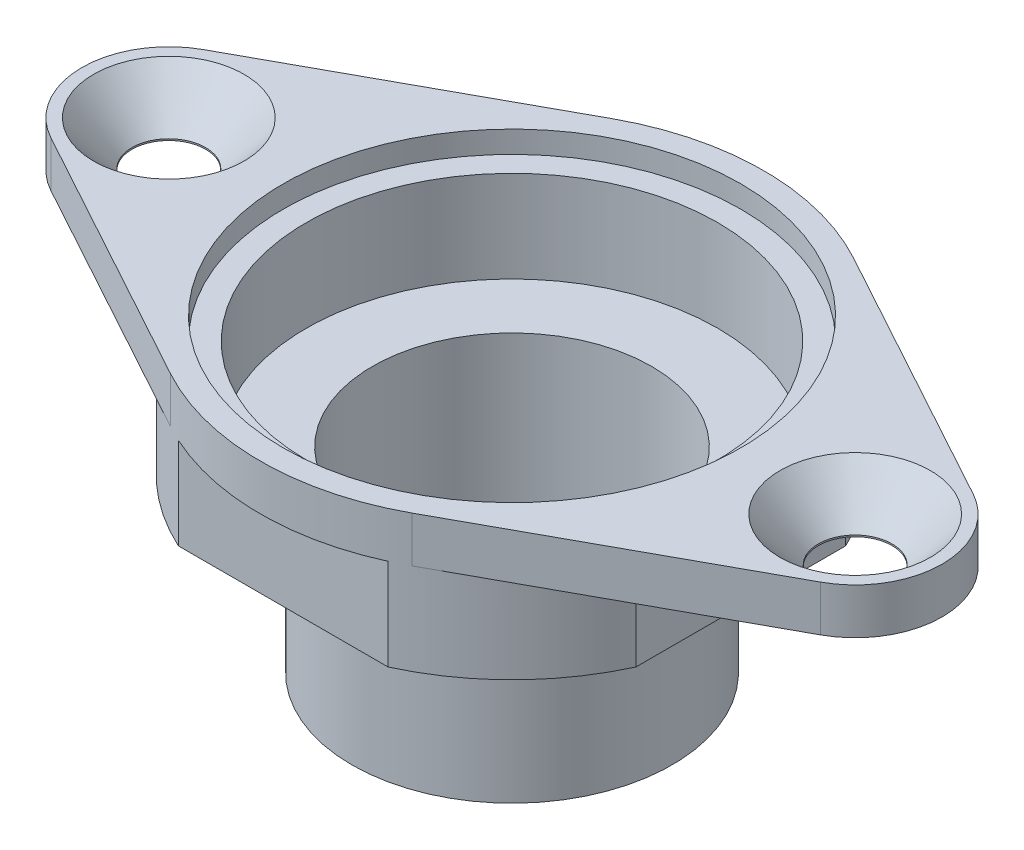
ISO-10303-21;
HEADER;
FILE_DESCRIPTION(('STEP AP214'),'2;1');
FILE_NAME('part.step','',(''),(''),'','','');
FILE_SCHEMA(('AUTOMOTIVE_DESIGN { 1 0 10303 214 1 1 1 1 }'));
ENDSEC;
DATA;
#1=APPLICATION_CONTEXT('core data for automotive mechanical design processes');
#2=APPLICATION_PROTOCOL_DEFINITION('international standard','automotive_design',2000,#1);
#3=PRODUCT_CONTEXT('',#1,'mechanical');
#4=PRODUCT('Part','Part','',(#3));
#5=PRODUCT_RELATED_PRODUCT_CATEGORY('part','',(#4));
#6=PRODUCT_DEFINITION_FORMATION('','',#4);
#7=PRODUCT_DEFINITION_CONTEXT('part definition',#1,'design');
#8=PRODUCT_DEFINITION('design','',#6,#7);
#9=PRODUCT_DEFINITION_SHAPE('','',#8);
#10=(LENGTH_UNIT() NAMED_UNIT(*) SI_UNIT(.MILLI.,.METRE.));
#11=(NAMED_UNIT(*) PLANE_ANGLE_UNIT() SI_UNIT($,.RADIAN.));
#12=(NAMED_UNIT(*) SI_UNIT($,.STERADIAN.) SOLID_ANGLE_UNIT());
#13=UNCERTAINTY_MEASURE_WITH_UNIT(LENGTH_MEASURE(1.E-05),#10,'distance_accuracy_value','');
#14=(GEOMETRIC_REPRESENTATION_CONTEXT(3) GLOBAL_UNCERTAINTY_ASSIGNED_CONTEXT((#13)) GLOBAL_UNIT_ASSIGNED_CONTEXT((#10,
#11,#12)) REPRESENTATION_CONTEXT('',''));
#15=CARTESIAN_POINT('',(0.,0.,0.));
#16=DIRECTION('',(0.,0.,1.));
#17=DIRECTION('',(1.,0.,0.));
#18=AXIS2_PLACEMENT_3D('',#15,#16,#17);
#19=CARTESIAN_POINT('',(58.4581,-3.175,-20.10787784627));
#20=DIRECTION('',(0.48,0.,0.877268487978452));
#21=DIRECTION('',(0.877268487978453,0.,-0.48));
#22=AXIS2_PLACEMENT_3D('',#19,#20,#21);
#23=PLANE('',#22);
#24=DIRECTION('',(0.,1.,0.));
#25=VECTOR('',#24,1.);
#26=CARTESIAN_POINT('',(40.132,-3.175,-10.0806990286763));
#27=LINE('',#26,#25);
#28=CARTESIAN_POINT('',(40.132,19.05,-10.0806990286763));
#29=VERTEX_POINT('',#28);
#30=CARTESIAN_POINT('',(40.132,22.225,-10.0806990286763));
#31=VERTEX_POINT('',#30);
#32=EDGE_CURVE('E313',#29,#31,#27,.T.);
#33=ORIENTED_EDGE('',*,*,#32,.F.);
#34=DIRECTION('',(0.877268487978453,0.,-0.48));
#35=VECTOR('',#34,1.);
#36=CARTESIAN_POINT('',(58.4581,19.05,-20.10787784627));
#37=LINE('',#36,#35);
#38=CARTESIAN_POINT('',(58.4581,19.05,-20.10787784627));
#39=VERTEX_POINT('',#38);
#40=EDGE_CURVE('E275',#29,#39,#37,.T.);
#41=ORIENTED_EDGE('',*,*,#40,.T.);
#42=DIRECTION('',(0.,1.,0.));
#43=VECTOR('',#42,1.);
#44=CARTESIAN_POINT('',(58.4581,-3.175,-20.10787784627));
#45=LINE('',#44,#43);
#46=CARTESIAN_POINT('',(58.4581,22.225,-20.10787784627));
#47=VERTEX_POINT('',#46);
#48=EDGE_CURVE('E200',#39,#47,#45,.T.);
#49=ORIENTED_EDGE('',*,*,#48,.T.);
#50=DIRECTION('',(0.877268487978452,0.,-0.48));
#51=VECTOR('',#50,1.);
#52=CARTESIAN_POINT('',(58.4581,22.225,-20.10787784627));
#53=LINE('',#52,#51);
#54=EDGE_CURVE('E195',#31,#47,#53,.T.);
#55=ORIENTED_EDGE('',*,*,#54,.F.);
#56=EDGE_LOOP('',(#33,#41,#49,#55));
#57=FACE_BOUND('',#56,.T.);
#58=ADVANCED_FACE('F40',(#57),#23,.T.);
#59=CARTESIAN_POINT('',(5.04190000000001,-3.175,-20.10787784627));
#60=DIRECTION('',(-0.48,0.,0.877268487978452));
#61=DIRECTION('',(0.877268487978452,0.,0.48));
#62=AXIS2_PLACEMENT_3D('',#59,#60,#61);
#63=PLANE('',#62);
#64=DIRECTION('',(0.877268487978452,0.,0.48));
#65=VECTOR('',#64,1.);
#66=CARTESIAN_POINT('',(5.04190000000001,19.05,-20.10787784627));
#67=LINE('',#66,#65);
#68=CARTESIAN_POINT('',(5.04190000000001,19.05,-20.10787784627));
#69=VERTEX_POINT('',#68);
#70=CARTESIAN_POINT('',(23.368,19.05,-10.0806990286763));
#71=VERTEX_POINT('',#70);
#72=EDGE_CURVE('E281',#69,#71,#67,.T.);
#73=ORIENTED_EDGE('',*,*,#72,.T.);
#74=DIRECTION('',(0.,1.,0.));
#75=VECTOR('',#74,1.);
#76=CARTESIAN_POINT('',(23.368,-3.175,-10.0806990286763));
#77=LINE('',#76,#75);
#78=CARTESIAN_POINT('',(23.368,22.225,-10.0806990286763));
#79=VERTEX_POINT('',#78);
#80=EDGE_CURVE('E315',#71,#79,#77,.T.);
#81=ORIENTED_EDGE('',*,*,#80,.T.);
#82=DIRECTION('',(0.877268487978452,0.,0.48));
#83=VECTOR('',#82,1.);
#84=CARTESIAN_POINT('',(5.04190000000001,22.225,-20.10787784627));
#85=LINE('',#84,#83);
#86=CARTESIAN_POINT('',(5.0419,22.225,-20.10787784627));
#87=VERTEX_POINT('',#86);
#88=EDGE_CURVE('E304',#87,#79,#85,.T.);
#89=ORIENTED_EDGE('',*,*,#88,.F.);
#90=DIRECTION('',(0.,1.,0.));
#91=VECTOR('',#90,1.);
#92=CARTESIAN_POINT('',(5.0419,-3.175,-20.10787784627));
#93=LINE('',#92,#91);
#94=EDGE_CURVE('E188',#69,#87,#93,.T.);
#95=ORIENTED_EDGE('',*,*,#94,.F.);
#96=EDGE_LOOP('',(#73,#81,#89,#95));
#97=FACE_BOUND('',#96,.T.);
#98=ADVANCED_FACE('F322',(#97),#63,.T.);
#99=CARTESIAN_POINT('',(5.0419,-3.175,-30.69212215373));
#100=DIRECTION('',(-0.48,0.,-0.877268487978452));
#101=DIRECTION('',(-0.877268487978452,0.,0.48));
#102=AXIS2_PLACEMENT_3D('',#99,#100,#101);
#103=PLANE('',#102);
#104=DIRECTION('',(0.,1.,0.));
#105=VECTOR('',#104,1.);
#106=CARTESIAN_POINT('',(23.368,-3.175,-40.7193009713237));
#107=LINE('',#106,#105);
#108=CARTESIAN_POINT('',(23.368,19.05,-40.7193009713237));
#109=VERTEX_POINT('',#108);
#110=CARTESIAN_POINT('',(23.368,22.225,-40.7193009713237));
#111=VERTEX_POINT('',#110);
#112=EDGE_CURVE('E173',#109,#111,#107,.T.);
#113=ORIENTED_EDGE('',*,*,#112,.F.);
#114=DIRECTION('',(-0.877268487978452,0.,0.48));
#115=VECTOR('',#114,1.);
#116=CARTESIAN_POINT('',(5.0419,19.05,-30.69212215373));
#117=LINE('',#116,#115);
#118=CARTESIAN_POINT('',(5.0419,19.05,-30.69212215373));
#119=VERTEX_POINT('',#118);
#120=EDGE_CURVE('E156',#109,#119,#117,.T.);
#121=ORIENTED_EDGE('',*,*,#120,.T.);
#122=DIRECTION('',(0.,1.,0.));
#123=VECTOR('',#122,1.);
#124=CARTESIAN_POINT('',(5.0419,-3.175,-30.69212215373));
#125=LINE('',#124,#123);
#126=CARTESIAN_POINT('',(5.0419,22.225,-30.69212215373));
#127=VERTEX_POINT('',#126);
#128=EDGE_CURVE('E185',#119,#127,#125,.T.);
#129=ORIENTED_EDGE('',*,*,#128,.T.);
#130=DIRECTION('',(-0.877268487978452,0.,0.48));
#131=VECTOR('',#130,1.);
#132=CARTESIAN_POINT('',(5.0419,22.225,-30.69212215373));
#133=LINE('',#132,#131);
#134=EDGE_CURVE('E183',#111,#127,#133,.T.);
#135=ORIENTED_EDGE('',*,*,#134,.F.);
#136=EDGE_LOOP('',(#113,#121,#129,#135));
#137=FACE_BOUND('',#136,.T.);
#138=ADVANCED_FACE('F181',(#137),#103,.T.);
#139=CARTESIAN_POINT('',(40.132,-3.175,-40.7193009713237));
#140=DIRECTION('',(0.48,0.,-0.877268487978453));
#141=DIRECTION('',(-0.877268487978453,0.,-0.48));
#142=AXIS2_PLACEMENT_3D('',#139,#140,#141);
#143=PLANE('',#142);
#144=DIRECTION('',(-0.877268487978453,0.,-0.48));
#145=VECTOR('',#144,1.);
#146=CARTESIAN_POINT('',(40.132,19.05,-40.7193009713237));
#147=LINE('',#146,#145);
#148=CARTESIAN_POINT('',(58.4581,19.05,-30.69212215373));
#149=VERTEX_POINT('',#148);
#150=CARTESIAN_POINT('',(40.132,19.05,-40.7193009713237));
#151=VERTEX_POINT('',#150);
#152=EDGE_CURVE('E219',#149,#151,#147,.T.);
#153=ORIENTED_EDGE('',*,*,#152,.T.);
#154=DIRECTION('',(0.,1.,0.));
#155=VECTOR('',#154,1.);
#156=CARTESIAN_POINT('',(40.132,-3.175,-40.7193009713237));
#157=LINE('',#156,#155);
#158=CARTESIAN_POINT('',(40.132,22.225,-40.7193009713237));
#159=VERTEX_POINT('',#158);
#160=EDGE_CURVE('E186',#151,#159,#157,.T.);
#161=ORIENTED_EDGE('',*,*,#160,.T.);
#162=DIRECTION('',(-0.877268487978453,0.,-0.48));
#163=VECTOR('',#162,1.);
#164=CARTESIAN_POINT('',(40.132,22.225,-40.7193009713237));
#165=LINE('',#164,#163);
#166=CARTESIAN_POINT('',(58.4581,22.225,-30.69212215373));
#167=VERTEX_POINT('',#166);
#168=EDGE_CURVE('E295',#167,#159,#165,.T.);
#169=ORIENTED_EDGE('',*,*,#168,.F.);
#170=DIRECTION('',(0.,1.,0.));
#171=VECTOR('',#170,1.);
#172=CARTESIAN_POINT('',(58.4581,-3.175,-30.69212215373));
#173=LINE('',#172,#171);
#174=EDGE_CURVE('E190',#149,#167,#173,.T.);
#175=ORIENTED_EDGE('',*,*,#174,.F.);
#176=EDGE_LOOP('',(#153,#161,#169,#175));
#177=FACE_BOUND('',#176,.T.);
#178=ADVANCED_FACE('F331',(#177),#143,.T.);
#179=CARTESIAN_POINT('',(47.625,19.05,-9.52499999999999));
#180=DIRECTION('',(1.,0.,0.));
#181=DIRECTION('',(0.,0.,-1.));
#182=AXIS2_PLACEMENT_3D('',#179,#180,#181);
#183=PLANE('',#182);
#184=DIRECTION('',(0.,0.,1.));
#185=VECTOR('',#184,1.);
#186=CARTESIAN_POINT('',(47.625,19.05,-9.52499999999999));
#187=LINE('',#186,#185);
#188=CARTESIAN_POINT('',(47.625,19.05,-32.6748389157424));
#189=VERTEX_POINT('',#188);
#190=CARTESIAN_POINT('',(47.625,19.05,-18.1251610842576));
#191=VERTEX_POINT('',#190);
#192=EDGE_CURVE('E266',#189,#191,#187,.T.);
#193=ORIENTED_EDGE('',*,*,#192,.T.);
#194=DIRECTION('',(0.,-1.,0.));
#195=VECTOR('',#194,1.);
#196=CARTESIAN_POINT('',(47.625,88.8982857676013,-18.1251610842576));
#197=LINE('',#196,#195);
#198=CARTESIAN_POINT('',(47.625,12.7,-18.1251610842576));
#199=VERTEX_POINT('',#198);
#200=EDGE_CURVE('E245',#191,#199,#197,.T.);
#201=ORIENTED_EDGE('',*,*,#200,.T.);
#202=DIRECTION('',(0.,0.,-1.));
#203=VECTOR('',#202,1.);
#204=CARTESIAN_POINT('',(47.625,12.7,-9.52499999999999));
#205=LINE('',#204,#203);
#206=CARTESIAN_POINT('',(47.625,12.7,-32.6748389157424));
#207=VERTEX_POINT('',#206);
#208=EDGE_CURVE('E250',#199,#207,#205,.T.);
#209=ORIENTED_EDGE('',*,*,#208,.T.);
#210=DIRECTION('',(0.,-1.,0.));
#211=VECTOR('',#210,1.);
#212=CARTESIAN_POINT('',(47.625,88.8982857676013,-32.6748389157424));
#213=LINE('',#212,#211);
#214=EDGE_CURVE('E342',#207,#189,#213,.F.);
#215=ORIENTED_EDGE('',*,*,#214,.T.);
#216=EDGE_LOOP('',(#193,#201,#209,#215));
#217=FACE_BOUND('',#216,.T.);
#218=ADVANCED_FACE('F345',(#217),#183,.T.);
#219=CARTESIAN_POINT('',(15.875,19.05,-9.52499999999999));
#220=DIRECTION('',(-1.,0.,0.));
#221=DIRECTION('',(0.,0.,1.));
#222=AXIS2_PLACEMENT_3D('',#219,#220,#221);
#223=PLANE('',#222);
#224=DIRECTION('',(0.,0.,-1.));
#225=VECTOR('',#224,1.);
#226=CARTESIAN_POINT('',(15.875,19.05,-9.52499999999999));
#227=LINE('',#226,#225);
#228=CARTESIAN_POINT('',(15.875,19.05,-18.1251610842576));
#229=VERTEX_POINT('',#228);
#230=CARTESIAN_POINT('',(15.875,19.05,-32.6748389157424));
#231=VERTEX_POINT('',#230);
#232=EDGE_CURVE('E261',#229,#231,#227,.T.);
#233=ORIENTED_EDGE('',*,*,#232,.T.);
#234=DIRECTION('',(0.,-1.,0.));
#235=VECTOR('',#234,1.);
#236=CARTESIAN_POINT('',(15.875,88.8982857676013,-32.6748389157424));
#237=LINE('',#236,#235);
#238=CARTESIAN_POINT('',(15.875,12.7,-32.6748389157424));
#239=VERTEX_POINT('',#238);
#240=EDGE_CURVE('E176',#231,#239,#237,.T.);
#241=ORIENTED_EDGE('',*,*,#240,.T.);
#242=DIRECTION('',(0.,0.,1.));
#243=VECTOR('',#242,1.);
#244=CARTESIAN_POINT('',(15.875,12.7,-9.52499999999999));
#245=LINE('',#244,#243);
#246=CARTESIAN_POINT('',(15.875,12.7,-18.1251610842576));
#247=VERTEX_POINT('',#246);
#248=EDGE_CURVE('E254',#239,#247,#245,.T.);
#249=ORIENTED_EDGE('',*,*,#248,.T.);
#250=DIRECTION('',(0.,-1.,0.));
#251=VECTOR('',#250,1.);
#252=CARTESIAN_POINT('',(15.875,88.8982857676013,-18.1251610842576));
#253=LINE('',#252,#251);
#254=EDGE_CURVE('E177',#247,#229,#253,.F.);
#255=ORIENTED_EDGE('',*,*,#254,.T.);
#256=EDGE_LOOP('',(#233,#241,#249,#255));
#257=FACE_BOUND('',#256,.T.);
#258=ADVANCED_FACE('F516',(#257),#223,.T.);
#259=CARTESIAN_POINT('',(31.75,12.7,-25.4));
#260=DIRECTION('',(0.,-1.,0.));
#261=DIRECTION('',(0.,0.,-1.));
#262=AXIS2_PLACEMENT_3D('',#259,#260,#261);
#263=PLANE('',#262);
#264=CARTESIAN_POINT('',(31.75,12.7,-25.4));
#265=DIRECTION('',(0.,-1.,0.));
#266=DIRECTION('',(0.,0.,-1.));
#267=AXIS2_PLACEMENT_3D('',#264,#265,#266);
#268=CIRCLE('',#267,11.1125);
#269=CARTESIAN_POINT('',(31.75,12.7,-36.5125));
#270=VERTEX_POINT('',#269);
#271=EDGE_CURVE('E233',#270,#270,#268,.T.);
#272=ORIENTED_EDGE('',*,*,#271,.F.);
#273=EDGE_LOOP('',(#272));
#274=FACE_BOUND('',#273,.T.);
#275=CARTESIAN_POINT('',(31.75,12.7,-25.4));
#276=DIRECTION('',(0.,-1.,0.));
#277=DIRECTION('',(0.,0.,-1.));
#278=AXIS2_PLACEMENT_3D('',#275,#276,#277);
#279=CIRCLE('',#278,17.4625);
#280=CARTESIAN_POINT('',(39.0248389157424,12.7,-41.275));
#281=VERTEX_POINT('',#280);
#282=EDGE_CURVE('E64',#207,#281,#279,.F.);
#283=ORIENTED_EDGE('',*,*,#282,.F.);
#284=ORIENTED_EDGE('',*,*,#208,.F.);
#285=CARTESIAN_POINT('',(31.75,12.7,-25.4));
#286=DIRECTION('',(0.,-1.,0.));
#287=DIRECTION('',(0.,0.,-1.));
#288=AXIS2_PLACEMENT_3D('',#285,#286,#287);
#289=CIRCLE('',#288,17.4625);
#290=CARTESIAN_POINT('',(39.0248389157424,12.7,-9.525));
#291=VERTEX_POINT('',#290);
#292=EDGE_CURVE('E238',#291,#199,#289,.F.);
#293=ORIENTED_EDGE('',*,*,#292,.F.);
#294=DIRECTION('',(1.,0.,0.));
#295=VECTOR('',#294,1.);
#296=CARTESIAN_POINT('',(15.875,12.7,-9.52499999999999));
#297=LINE('',#296,#295);
#298=CARTESIAN_POINT('',(24.4751610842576,12.7,-9.52499999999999));
#299=VERTEX_POINT('',#298);
#300=EDGE_CURVE('E12',#299,#291,#297,.T.);
#301=ORIENTED_EDGE('',*,*,#300,.F.);
#302=EDGE_CURVE('E57',#247,#299,#289,.F.);
#303=ORIENTED_EDGE('',*,*,#302,.F.);
#304=ORIENTED_EDGE('',*,*,#248,.F.);
#305=CARTESIAN_POINT('',(24.4751610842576,12.7,-41.275));
#306=VERTEX_POINT('',#305);
#307=EDGE_CURVE('E255',#306,#239,#279,.F.);
#308=ORIENTED_EDGE('',*,*,#307,.F.);
#309=DIRECTION('',(-1.,0.,0.));
#310=VECTOR('',#309,1.);
#311=CARTESIAN_POINT('',(15.875,12.7,-41.275));
#312=LINE('',#311,#310);
#313=EDGE_CURVE('E258',#281,#306,#312,.T.);
#314=ORIENTED_EDGE('',*,*,#313,.F.);
#315=EDGE_LOOP('',(#283,#284,#293,#301,#303,#304,#308,#314));
#316=FACE_BOUND('',#315,.T.);
#317=ADVANCED_FACE('F348',(#274,#316),#263,.T.);
#318=CARTESIAN_POINT('',(31.75,-3.175,-25.4));
#319=DIRECTION('',(0.,1.,0.));
#320=DIRECTION('',(0.,0.,1.));
#321=AXIS2_PLACEMENT_3D('',#318,#319,#320);
#322=CYLINDRICAL_SURFACE('',#321,17.4625);
#323=ORIENTED_EDGE('',*,*,#292,.T.);
#324=ORIENTED_EDGE('',*,*,#200,.F.);
#325=CARTESIAN_POINT('',(31.75,19.05,-25.4));
#326=DIRECTION('',(0.,-1.,0.));
#327=DIRECTION('',(0.,0.,-1.));
#328=AXIS2_PLACEMENT_3D('',#325,#326,#327);
#329=CIRCLE('',#328,17.4625);
#330=EDGE_CURVE('E338',#29,#191,#329,.F.);
#331=ORIENTED_EDGE('',*,*,#330,.F.);
#332=ORIENTED_EDGE('',*,*,#32,.T.);
#333=CARTESIAN_POINT('',(31.75,22.225,-25.4));
#334=DIRECTION('',(0.,1.,0.));
#335=DIRECTION('',(0.,0.,1.));
#336=AXIS2_PLACEMENT_3D('',#333,#334,#335);
#337=CIRCLE('',#336,17.4625);
#338=EDGE_CURVE('E307',#79,#31,#337,.T.);
#339=ORIENTED_EDGE('',*,*,#338,.F.);
#340=ORIENTED_EDGE('',*,*,#80,.F.);
#341=EDGE_CURVE('E178',#229,#71,#329,.F.);
#342=ORIENTED_EDGE('',*,*,#341,.F.);
#343=ORIENTED_EDGE('',*,*,#254,.F.);
#344=ORIENTED_EDGE('',*,*,#302,.T.);
#345=DIRECTION('',(0.,1.,0.));
#346=VECTOR('',#345,1.);
#347=CARTESIAN_POINT('',(24.4751610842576,-3.175,-9.525));
#348=LINE('',#347,#346);
#349=CARTESIAN_POINT('',(24.4751610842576,19.05,-9.525));
#350=VERTEX_POINT('',#349);
#351=EDGE_CURVE('E228',#299,#350,#348,.T.);
#352=ORIENTED_EDGE('',*,*,#351,.T.);
#353=CARTESIAN_POINT('',(31.75,19.05,-25.4));
#354=DIRECTION('',(0.,-1.,0.));
#355=DIRECTION('',(0.,0.,-1.));
#356=AXIS2_PLACEMENT_3D('',#353,#354,#355);
#357=CIRCLE('',#356,17.4625);
#358=CARTESIAN_POINT('',(39.0248389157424,19.05,-9.52499999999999));
#359=VERTEX_POINT('',#358);
#360=EDGE_CURVE('E283',#350,#359,#357,.F.);
#361=ORIENTED_EDGE('',*,*,#360,.T.);
#362=DIRECTION('',(0.,1.,0.));
#363=VECTOR('',#362,1.);
#364=CARTESIAN_POINT('',(39.0248389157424,-3.175,-9.525));
#365=LINE('',#364,#363);
#366=EDGE_CURVE('E49',#359,#291,#365,.F.);
#367=ORIENTED_EDGE('',*,*,#366,.T.);
#368=EDGE_LOOP('',(#323,#324,#331,#332,#339,#340,#342,#343,#344,#352,#361,#367));
#369=FACE_BOUND('',#368,.T.);
#370=ADVANCED_FACE('F353',(#369),#322,.T.);
#371=CARTESIAN_POINT('',(31.75,-3.175,-25.4));
#372=DIRECTION('',(0.,1.,0.));
#373=DIRECTION('',(0.,0.,1.));
#374=AXIS2_PLACEMENT_3D('',#371,#372,#373);
#375=CYLINDRICAL_SURFACE('',#374,17.4625);
#376=DIRECTION('',(0.,1.,0.));
#377=VECTOR('',#376,1.);
#378=CARTESIAN_POINT('',(39.0248389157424,-3.175,-41.275));
#379=LINE('',#378,#377);
#380=CARTESIAN_POINT('',(39.0248389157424,19.05,-41.275));
#381=VERTEX_POINT('',#380);
#382=EDGE_CURVE('E223',#281,#381,#379,.T.);
#383=ORIENTED_EDGE('',*,*,#382,.T.);
#384=CARTESIAN_POINT('',(31.75,19.05,-25.4));
#385=DIRECTION('',(0.,-1.,0.));
#386=DIRECTION('',(0.,0.,-1.));
#387=AXIS2_PLACEMENT_3D('',#384,#385,#386);
#388=CIRCLE('',#387,17.4625);
#389=CARTESIAN_POINT('',(24.4751610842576,19.05,-41.275));
#390=VERTEX_POINT('',#389);
#391=EDGE_CURVE('E168',#381,#390,#388,.F.);
#392=ORIENTED_EDGE('',*,*,#391,.T.);
#393=DIRECTION('',(0.,1.,0.));
#394=VECTOR('',#393,1.);
#395=CARTESIAN_POINT('',(24.4751610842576,-3.175,-41.275));
#396=LINE('',#395,#394);
#397=EDGE_CURVE('E225',#390,#306,#396,.F.);
#398=ORIENTED_EDGE('',*,*,#397,.T.);
#399=ORIENTED_EDGE('',*,*,#307,.T.);
#400=ORIENTED_EDGE('',*,*,#240,.F.);
#401=EDGE_CURVE('E161',#109,#231,#329,.F.);
#402=ORIENTED_EDGE('',*,*,#401,.F.);
#403=ORIENTED_EDGE('',*,*,#112,.T.);
#404=CARTESIAN_POINT('',(31.75,22.225,-25.4));
#405=DIRECTION('',(0.,1.,0.));
#406=DIRECTION('',(0.,0.,1.));
#407=AXIS2_PLACEMENT_3D('',#404,#405,#406);
#408=CIRCLE('',#407,17.4625);
#409=EDGE_CURVE('E298',#159,#111,#408,.T.);
#410=ORIENTED_EDGE('',*,*,#409,.F.);
#411=ORIENTED_EDGE('',*,*,#160,.F.);
#412=EDGE_CURVE('E180',#189,#151,#329,.F.);
#413=ORIENTED_EDGE('',*,*,#412,.F.);
#414=ORIENTED_EDGE('',*,*,#214,.F.);
#415=ORIENTED_EDGE('',*,*,#282,.T.);
#416=EDGE_LOOP('',(#383,#392,#398,#399,#400,#402,#403,#410,#411,#413,#414,#415));
#417=FACE_BOUND('',#416,.T.);
#418=ADVANCED_FACE('F171',(#417),#375,.T.);
#419=CARTESIAN_POINT('',(15.875,19.05,-41.275));
#420=DIRECTION('',(0.,0.,-1.));
#421=DIRECTION('',(-1.,0.,0.));
#422=AXIS2_PLACEMENT_3D('',#419,#420,#421);
#423=PLANE('',#422);
#424=ORIENTED_EDGE('',*,*,#382,.F.);
#425=ORIENTED_EDGE('',*,*,#313,.T.);
#426=ORIENTED_EDGE('',*,*,#397,.F.);
#427=DIRECTION('',(1.,0.,0.));
#428=VECTOR('',#427,1.);
#429=CARTESIAN_POINT('',(15.875,19.05,-41.275));
#430=LINE('',#429,#428);
#431=EDGE_CURVE('E263',#390,#381,#430,.T.);
#432=ORIENTED_EDGE('',*,*,#431,.T.);
#433=EDGE_LOOP('',(#424,#425,#426,#432));
#434=FACE_BOUND('',#433,.T.);
#435=ADVANCED_FACE('F389',(#434),#423,.T.);
#436=CARTESIAN_POINT('',(15.875,19.05,-9.52499999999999));
#437=DIRECTION('',(0.,0.,1.));
#438=DIRECTION('',(1.,0.,0.));
#439=AXIS2_PLACEMENT_3D('',#436,#437,#438);
#440=PLANE('',#439);
#441=ORIENTED_EDGE('',*,*,#351,.F.);
#442=ORIENTED_EDGE('',*,*,#300,.T.);
#443=ORIENTED_EDGE('',*,*,#366,.F.);
#444=DIRECTION('',(-1.,0.,0.));
#445=VECTOR('',#444,1.);
#446=CARTESIAN_POINT('',(15.875,19.05,-9.52499999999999));
#447=LINE('',#446,#445);
#448=EDGE_CURVE('E269',#359,#350,#447,.T.);
#449=ORIENTED_EDGE('',*,*,#448,.T.);
#450=EDGE_LOOP('',(#441,#442,#443,#449));
#451=FACE_BOUND('',#450,.T.);
#452=ADVANCED_FACE('F351',(#451),#440,.T.);
#453=CARTESIAN_POINT('',(55.5625,22.225,-25.4));
#454=DIRECTION('',(0.,1.,0.));
#455=DIRECTION('',(0.,0.,1.));
#456=AXIS2_PLACEMENT_3D('',#453,#454,#455);
#457=CYLINDRICAL_SURFACE('',#456,2.5527);
#458=CARTESIAN_POINT('',(55.5625,19.1558132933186,-25.4));
#459=DIRECTION('',(0.,1.,0.));
#460=DIRECTION('',(0.,0.,1.));
#461=AXIS2_PLACEMENT_3D('',#458,#459,#460);
#462=CIRCLE('',#461,2.5527);
#463=CARTESIAN_POINT('',(55.5625,19.1558132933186,-22.8473));
#464=VERTEX_POINT('',#463);
#465=EDGE_CURVE('E206',#464,#464,#462,.T.);
#466=ORIENTED_EDGE('',*,*,#465,.T.);
#467=EDGE_LOOP('',(#466));
#468=FACE_BOUND('',#467,.T.);
#469=CARTESIAN_POINT('',(55.5625,19.05,-25.4));
#470=DIRECTION('',(0.,-1.,0.));
#471=DIRECTION('',(0.,0.,-1.));
#472=AXIS2_PLACEMENT_3D('',#469,#470,#471);
#473=CIRCLE('',#472,2.5527);
#474=CARTESIAN_POINT('',(55.5625,19.05,-27.9527));
#475=VERTEX_POINT('',#474);
#476=EDGE_CURVE('E289',#475,#475,#473,.F.);
#477=ORIENTED_EDGE('',*,*,#476,.F.);
#478=EDGE_LOOP('',(#477));
#479=FACE_BOUND('',#478,.T.);
#480=ADVANCED_FACE('F403',(#468,#479),#457,.F.);
#481=CARTESIAN_POINT('',(7.93750000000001,22.225,-25.4));
#482=DIRECTION('',(0.,1.,0.));
#483=DIRECTION('',(0.,0.,1.));
#484=AXIS2_PLACEMENT_3D('',#481,#482,#483);
#485=CYLINDRICAL_SURFACE('',#484,2.5527);
#486=CARTESIAN_POINT('',(7.93750000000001,19.1558132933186,-25.4));
#487=DIRECTION('',(0.,1.,0.));
#488=DIRECTION('',(0.,0.,1.));
#489=AXIS2_PLACEMENT_3D('',#486,#487,#488);
#490=CIRCLE('',#489,2.5527);
#491=CARTESIAN_POINT('',(7.93750000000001,19.1558132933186,-22.8473));
#492=VERTEX_POINT('',#491);
#493=EDGE_CURVE('E199',#492,#492,#490,.T.);
#494=ORIENTED_EDGE('',*,*,#493,.T.);
#495=EDGE_LOOP('',(#494));
#496=FACE_BOUND('',#495,.T.);
#497=CARTESIAN_POINT('',(7.93750000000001,19.05,-25.4));
#498=DIRECTION('',(0.,-1.,0.));
#499=DIRECTION('',(0.,0.,-1.));
#500=AXIS2_PLACEMENT_3D('',#497,#498,#499);
#501=CIRCLE('',#500,2.5527);
#502=CARTESIAN_POINT('',(7.93750000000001,19.05,-27.9527));
#503=VERTEX_POINT('',#502);
#504=EDGE_CURVE('E286',#503,#503,#501,.F.);
#505=ORIENTED_EDGE('',*,*,#504,.F.);
#506=EDGE_LOOP('',(#505));
#507=FACE_BOUND('',#506,.T.);
#508=ADVANCED_FACE('F394',(#496,#507),#485,.F.);
#509=CARTESIAN_POINT('',(55.5625,-3.175,-25.4));
#510=DIRECTION('',(0.,1.,0.));
#511=DIRECTION('',(0.,0.,1.));
#512=AXIS2_PLACEMENT_3D('',#509,#510,#511);
#513=CYLINDRICAL_SURFACE('',#512,6.0325);
#514=ORIENTED_EDGE('',*,*,#48,.F.);
#515=CARTESIAN_POINT('',(55.5625,19.05,-25.4));
#516=DIRECTION('',(0.,-1.,0.));
#517=DIRECTION('',(0.,0.,-1.));
#518=AXIS2_PLACEMENT_3D('',#515,#516,#517);
#519=CIRCLE('',#518,6.0325);
#520=EDGE_CURVE('E272',#39,#149,#519,.F.);
#521=ORIENTED_EDGE('',*,*,#520,.T.);
#522=ORIENTED_EDGE('',*,*,#174,.T.);
#523=CARTESIAN_POINT('',(55.5625,22.225,-25.4));
#524=DIRECTION('',(0.,1.,0.));
#525=DIRECTION('',(0.,0.,1.));
#526=AXIS2_PLACEMENT_3D('',#523,#524,#525);
#527=CIRCLE('',#526,6.0325);
#528=EDGE_CURVE('E292',#47,#167,#527,.T.);
#529=ORIENTED_EDGE('',*,*,#528,.F.);
#530=EDGE_LOOP('',(#514,#521,#522,#529));
#531=FACE_BOUND('',#530,.T.);
#532=ADVANCED_FACE('F384',(#531),#513,.T.);
#533=CARTESIAN_POINT('',(7.93750000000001,-3.175,-25.4));
#534=DIRECTION('',(0.,1.,0.));
#535=DIRECTION('',(0.,0.,1.));
#536=AXIS2_PLACEMENT_3D('',#533,#534,#535);
#537=CYLINDRICAL_SURFACE('',#536,6.0325);
#538=ORIENTED_EDGE('',*,*,#128,.F.);
#539=CARTESIAN_POINT('',(7.93750000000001,19.05,-25.4));
#540=DIRECTION('',(0.,-1.,0.));
#541=DIRECTION('',(0.,0.,-1.));
#542=AXIS2_PLACEMENT_3D('',#539,#540,#541);
#543=CIRCLE('',#542,6.0325);
#544=EDGE_CURVE('E164',#119,#69,#543,.F.);
#545=ORIENTED_EDGE('',*,*,#544,.T.);
#546=ORIENTED_EDGE('',*,*,#94,.T.);
#547=CARTESIAN_POINT('',(7.93750000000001,22.225,-25.4));
#548=DIRECTION('',(0.,1.,0.));
#549=DIRECTION('',(0.,0.,1.));
#550=AXIS2_PLACEMENT_3D('',#547,#548,#549);
#551=CIRCLE('',#550,6.0325);
#552=EDGE_CURVE('E301',#127,#87,#551,.T.);
#553=ORIENTED_EDGE('',*,*,#552,.F.);
#554=EDGE_LOOP('',(#538,#545,#546,#553));
#555=FACE_BOUND('',#554,.T.);
#556=ADVANCED_FACE('F320',(#555),#537,.T.);
#557=CARTESIAN_POINT('',(0.,22.225,0.));
#558=DIRECTION('',(0.,-1.,0.));
#559=DIRECTION('',(0.,0.,-1.));
#560=AXIS2_PLACEMENT_3D('',#557,#558,#559);
#561=PLANE('',#560);
#562=CARTESIAN_POINT('',(31.75,22.225,-25.4));
#563=DIRECTION('',(0.,1.,0.));
#564=DIRECTION('',(0.,0.,1.));
#565=AXIS2_PLACEMENT_3D('',#562,#563,#564);
#566=CIRCLE('',#565,15.875);
#567=CARTESIAN_POINT('',(31.75,22.225,-9.525));
#568=VERTEX_POINT('',#567);
#569=EDGE_CURVE('E209',#568,#568,#566,.T.);
#570=ORIENTED_EDGE('',*,*,#569,.F.);
#571=EDGE_LOOP('',(#570));
#572=FACE_BOUND('',#571,.T.);
#573=CARTESIAN_POINT('',(55.5625,22.225,-25.4));
#574=DIRECTION('',(0.,1.,0.));
#575=DIRECTION('',(0.,0.,1.));
#576=AXIS2_PLACEMENT_3D('',#573,#574,#575);
#577=CIRCLE('',#576,5.2207033);
#578=CARTESIAN_POINT('',(55.5625,22.225,-20.1792967));
#579=VERTEX_POINT('',#578);
#580=EDGE_CURVE('E203',#579,#579,#577,.T.);
#581=ORIENTED_EDGE('',*,*,#580,.F.);
#582=EDGE_LOOP('',(#581));
#583=FACE_BOUND('',#582,.T.);
#584=CARTESIAN_POINT('',(7.93750000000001,22.225,-25.4));
#585=DIRECTION('',(0.,1.,0.));
#586=DIRECTION('',(0.,0.,1.));
#587=AXIS2_PLACEMENT_3D('',#584,#585,#586);
#588=CIRCLE('',#587,5.2207033);
#589=CARTESIAN_POINT('',(7.93750000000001,22.225,-20.1792967));
#590=VERTEX_POINT('',#589);
#591=EDGE_CURVE('E196',#590,#590,#588,.T.);
#592=ORIENTED_EDGE('',*,*,#591,.F.);
#593=EDGE_LOOP('',(#592));
#594=FACE_BOUND('',#593,.T.);
#595=ORIENTED_EDGE('',*,*,#528,.T.);
#596=ORIENTED_EDGE('',*,*,#168,.T.);
#597=ORIENTED_EDGE('',*,*,#409,.T.);
#598=ORIENTED_EDGE('',*,*,#134,.T.);
#599=ORIENTED_EDGE('',*,*,#552,.T.);
#600=ORIENTED_EDGE('',*,*,#88,.T.);
#601=ORIENTED_EDGE('',*,*,#338,.T.);
#602=ORIENTED_EDGE('',*,*,#54,.T.);
#603=EDGE_LOOP('',(#595,#596,#597,#598,#599,#600,#601,#602));
#604=FACE_BOUND('',#603,.T.);
#605=ADVANCED_FACE('F42',(#572,#583,#594,#604),#561,.F.);
#606=CARTESIAN_POINT('',(31.75,20.701,-25.4));
#607=DIRECTION('',(0.,1.,0.));
#608=DIRECTION('',(0.,0.,1.));
#609=AXIS2_PLACEMENT_3D('',#606,#607,#608);
#610=PLANE('',#609);
#611=CARTESIAN_POINT('',(31.75,20.701,-25.4));
#612=DIRECTION('',(0.,1.,0.));
#613=DIRECTION('',(0.,0.,1.));
#614=AXIS2_PLACEMENT_3D('',#611,#612,#613);
#615=CIRCLE('',#614,15.875);
#616=CARTESIAN_POINT('',(31.75,20.701,-9.525));
#617=VERTEX_POINT('',#616);
#618=EDGE_CURVE('E210',#617,#617,#615,.T.);
#619=ORIENTED_EDGE('',*,*,#618,.T.);
#620=EDGE_LOOP('',(#619));
#621=FACE_BOUND('',#620,.T.);
#622=CARTESIAN_POINT('',(31.75,20.701,-25.4));
#623=DIRECTION('',(0.,1.,0.));
#624=DIRECTION('',(0.,0.,1.));
#625=AXIS2_PLACEMENT_3D('',#622,#623,#624);
#626=CIRCLE('',#625,14.26845);
#627=CARTESIAN_POINT('',(31.75,20.701,-11.13155));
#628=VERTEX_POINT('',#627);
#629=EDGE_CURVE('E213',#628,#628,#626,.F.);
#630=ORIENTED_EDGE('',*,*,#629,.T.);
#631=EDGE_LOOP('',(#630));
#632=FACE_BOUND('',#631,.T.);
#633=ADVANCED_FACE('F412',(#621,#632),#610,.T.);
#634=CARTESIAN_POINT('',(31.75,20.701,-25.4));
#635=DIRECTION('',(0.,1.,0.));
#636=DIRECTION('',(0.,0.,1.));
#637=AXIS2_PLACEMENT_3D('',#634,#635,#636);
#638=CYLINDRICAL_SURFACE('',#637,15.875);
#639=CARTESIAN_POINT('',(31.75,20.701,-9.525));
#640=CARTESIAN_POINT('',(31.75,20.716875,-9.525));
#641=CARTESIAN_POINT('',(31.75,20.73275,-9.525));
#642=CARTESIAN_POINT('',(31.75,20.7645,-9.525));
#643=CARTESIAN_POINT('',(31.75,20.780375,-9.525));
#644=CARTESIAN_POINT('',(31.75,20.812125,-9.525));
#645=CARTESIAN_POINT('',(31.75,20.828,-9.525));
#646=CARTESIAN_POINT('',(31.75,20.85975,-9.525));
#647=CARTESIAN_POINT('',(31.75,20.875625,-9.525));
#648=CARTESIAN_POINT('',(31.75,20.907375,-9.525));
#649=CARTESIAN_POINT('',(31.75,20.92325,-9.525));
#650=CARTESIAN_POINT('',(31.75,20.955,-9.525));
#651=CARTESIAN_POINT('',(31.75,20.970875,-9.525));
#652=CARTESIAN_POINT('',(31.75,21.002625,-9.525));
#653=CARTESIAN_POINT('',(31.75,21.0185,-9.525));
#654=CARTESIAN_POINT('',(31.75,21.05025,-9.525));
#655=CARTESIAN_POINT('',(31.75,21.066125,-9.525));
#656=CARTESIAN_POINT('',(31.75,21.097875,-9.525));
#657=CARTESIAN_POINT('',(31.75,21.11375,-9.525));
#658=CARTESIAN_POINT('',(31.75,21.1455,-9.525));
#659=CARTESIAN_POINT('',(31.75,21.161375,-9.525));
#660=CARTESIAN_POINT('',(31.75,21.193125,-9.525));
#661=CARTESIAN_POINT('',(31.75,21.209,-9.525));
#662=CARTESIAN_POINT('',(31.75,21.24075,-9.525));
#663=CARTESIAN_POINT('',(31.75,21.256625,-9.525));
#664=CARTESIAN_POINT('',(31.75,21.288375,-9.525));
#665=CARTESIAN_POINT('',(31.75,21.30425,-9.525));
#666=CARTESIAN_POINT('',(31.75,21.336,-9.525));
#667=CARTESIAN_POINT('',(31.75,21.351875,-9.525));
#668=CARTESIAN_POINT('',(31.75,21.383625,-9.525));
#669=CARTESIAN_POINT('',(31.75,21.3995,-9.525));
#670=CARTESIAN_POINT('',(31.75,21.43125,-9.525));
#671=CARTESIAN_POINT('',(31.75,21.447125,-9.525));
#672=CARTESIAN_POINT('',(31.75,21.478875,-9.525));
#673=CARTESIAN_POINT('',(31.75,21.49475,-9.525));
#674=CARTESIAN_POINT('',(31.75,21.5265,-9.525));
#675=CARTESIAN_POINT('',(31.75,21.542375,-9.525));
#676=CARTESIAN_POINT('',(31.75,21.574125,-9.525));
#677=CARTESIAN_POINT('',(31.75,21.59,-9.525));
#678=CARTESIAN_POINT('',(31.75,21.62175,-9.525));
#679=CARTESIAN_POINT('',(31.75,21.637625,-9.525));
#680=CARTESIAN_POINT('',(31.75,21.669375,-9.525));
#681=CARTESIAN_POINT('',(31.75,21.68525,-9.525));
#682=CARTESIAN_POINT('',(31.75,21.717,-9.525));
#683=CARTESIAN_POINT('',(31.75,21.732875,-9.525));
#684=CARTESIAN_POINT('',(31.75,21.764625,-9.525));
#685=CARTESIAN_POINT('',(31.75,21.7805,-9.525));
#686=CARTESIAN_POINT('',(31.75,21.81225,-9.525));
#687=CARTESIAN_POINT('',(31.75,21.828125,-9.525));
#688=CARTESIAN_POINT('',(31.75,21.859875,-9.525));
#689=CARTESIAN_POINT('',(31.75,21.87575,-9.525));
#690=CARTESIAN_POINT('',(31.75,21.9075,-9.525));
#691=CARTESIAN_POINT('',(31.75,21.923375,-9.525));
#692=CARTESIAN_POINT('',(31.75,21.955125,-9.525));
#693=CARTESIAN_POINT('',(31.75,21.971,-9.525));
#694=CARTESIAN_POINT('',(31.75,22.00275,-9.525));
#695=CARTESIAN_POINT('',(31.75,22.018625,-9.525));
#696=CARTESIAN_POINT('',(31.75,22.050375,-9.525));
#697=CARTESIAN_POINT('',(31.75,22.06625,-9.525));
#698=CARTESIAN_POINT('',(31.75,22.098,-9.525));
#699=CARTESIAN_POINT('',(31.75,22.113875,-9.525));
#700=CARTESIAN_POINT('',(31.75,22.145625,-9.525));
#701=CARTESIAN_POINT('',(31.75,22.1615,-9.525));
#702=CARTESIAN_POINT('',(31.75,22.19325,-9.525));
#703=CARTESIAN_POINT('',(31.75,22.209125,-9.525));
#704=CARTESIAN_POINT('',(31.75,22.225,-9.525));
#705=B_SPLINE_CURVE_WITH_KNOTS('',3,(#639,#640,#641,#642,#643,#644,#645,#646,#647,#648,#649,
#650,#651,#652,#653,#654,#655,#656,#657,#658,#659,#660,#661,#662,#663,#664,#665,#666,#667,#668,
#669,#670,#671,#672,#673,#674,#675,#676,#677,#678,#679,#680,#681,#682,#683,#684,#685,#686,#687,
#688,#689,#690,#691,#692,#693,#694,#695,#696,#697,#698,#699,#700,#701,#702,#703,#704),
.UNSPECIFIED.,.F.,.F.,(4,2,2,2,2,2,2,2,2,2,2,2,2,2,2,2,2,2,2,2,2,2,2,2,2,2,2,2,2,2,2,2,4),(0.,
0.0476249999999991,0.0952499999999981,0.142874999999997,0.1905,0.238124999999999,
0.285749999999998,0.333374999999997,0.380999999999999,0.428624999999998,0.476249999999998,
0.523875,0.571499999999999,0.619124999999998,0.666749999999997,0.714375,0.761999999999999,
0.809624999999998,0.85725,0.904874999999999,0.952499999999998,1.000125,1.04775,1.095375,1.143,
1.190625,1.23825,1.285875,1.3335,1.381125,1.42875,1.476375,1.524),.UNSPECIFIED.);
#706=EDGE_CURVE('BSEAM415',#617,#568,#705,.T.);
#707=ORIENTED_EDGE('',*,*,#618,.F.);
#708=ORIENTED_EDGE('',*,*,#569,.T.);
#709=ORIENTED_EDGE('',*,*,#706,.T.);
#710=ORIENTED_EDGE('',*,*,#706,.F.);
#711=EDGE_LOOP('',(#707,#709,#708,#710));
#712=FACE_BOUND('',#711,.T.);
#713=ADVANCED_FACE('F415',(#712),#638,.F.);
#714=CARTESIAN_POINT('',(31.75,14.351,-25.4));
#715=DIRECTION('',(0.,1.,0.));
#716=DIRECTION('',(0.,0.,1.));
#717=AXIS2_PLACEMENT_3D('',#714,#715,#716);
#718=PLANE('',#717);
#719=CARTESIAN_POINT('',(31.75,14.351,-25.4));
#720=DIRECTION('',(0.,1.,0.));
#721=DIRECTION('',(0.,0.,1.));
#722=AXIS2_PLACEMENT_3D('',#719,#720,#721);
#723=CIRCLE('',#722,9.68375);
#724=CARTESIAN_POINT('',(31.75,14.351,-15.71625));
#725=VERTEX_POINT('',#724);
#726=EDGE_CURVE('E231',#725,#725,#723,.T.);
#727=ORIENTED_EDGE('',*,*,#726,.F.);
#728=EDGE_LOOP('',(#727));
#729=FACE_BOUND('',#728,.T.);
#730=CARTESIAN_POINT('',(31.75,14.351,-25.4));
#731=DIRECTION('',(0.,1.,0.));
#732=DIRECTION('',(0.,0.,1.));
#733=AXIS2_PLACEMENT_3D('',#730,#731,#732);
#734=CIRCLE('',#733,14.26845);
#735=CARTESIAN_POINT('',(31.75,14.351,-11.13155));
#736=VERTEX_POINT('',#735);
#737=EDGE_CURVE('E216',#736,#736,#734,.T.);
#738=ORIENTED_EDGE('',*,*,#737,.T.);
#739=EDGE_LOOP('',(#738));
#740=FACE_BOUND('',#739,.T.);
#741=ADVANCED_FACE('F419',(#729,#740),#718,.T.);
#742=CARTESIAN_POINT('',(31.75,14.351,-25.4));
#743=DIRECTION('',(0.,1.,0.));
#744=DIRECTION('',(0.,0.,1.));
#745=AXIS2_PLACEMENT_3D('',#742,#743,#744);
#746=CYLINDRICAL_SURFACE('',#745,14.26845);
#747=ORIENTED_EDGE('',*,*,#737,.F.);
#748=EDGE_LOOP('',(#747));
#749=FACE_BOUND('',#748,.T.);
#750=ORIENTED_EDGE('',*,*,#629,.F.);
#751=EDGE_LOOP('',(#750));
#752=FACE_BOUND('',#751,.T.);
#753=ADVANCED_FACE('F407',(#749,#752),#746,.F.);
#754=CARTESIAN_POINT('',(55.5625,22.225,-25.4));
#755=DIRECTION('',(0.,1.,0.));
#756=DIRECTION('',(0.,0.,1.));
#757=AXIS2_PLACEMENT_3D('',#754,#755,#756);
#758=CONICAL_SURFACE('',#757,5.2207033,0.715584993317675);
#759=ORIENTED_EDGE('',*,*,#465,.F.);
#760=EDGE_LOOP('',(#759));
#761=FACE_BOUND('',#760,.T.);
#762=ORIENTED_EDGE('',*,*,#580,.T.);
#763=EDGE_LOOP('',(#762));
#764=FACE_BOUND('',#763,.T.);
#765=ADVANCED_FACE('F399',(#761,#764),#758,.F.);
#766=CARTESIAN_POINT('',(7.93750000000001,22.225,-25.4));
#767=DIRECTION('',(0.,1.,0.));
#768=DIRECTION('',(0.,0.,1.));
#769=AXIS2_PLACEMENT_3D('',#766,#767,#768);
#770=CONICAL_SURFACE('',#769,5.2207033,0.715584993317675);
#771=ORIENTED_EDGE('',*,*,#493,.F.);
#772=EDGE_LOOP('',(#771));
#773=FACE_BOUND('',#772,.T.);
#774=ORIENTED_EDGE('',*,*,#591,.T.);
#775=EDGE_LOOP('',(#774));
#776=FACE_BOUND('',#775,.T.);
#777=ADVANCED_FACE('F396',(#773,#776),#770,.F.);
#778=CARTESIAN_POINT('',(31.75,19.05,-25.4));
#779=DIRECTION('',(0.,-1.,0.));
#780=DIRECTION('',(0.,0.,-1.));
#781=AXIS2_PLACEMENT_3D('',#778,#779,#780);
#782=PLANE('',#781);
#783=ORIENTED_EDGE('',*,*,#40,.F.);
#784=ORIENTED_EDGE('',*,*,#330,.T.);
#785=ORIENTED_EDGE('',*,*,#192,.F.);
#786=ORIENTED_EDGE('',*,*,#412,.T.);
#787=ORIENTED_EDGE('',*,*,#152,.F.);
#788=ORIENTED_EDGE('',*,*,#520,.F.);
#789=EDGE_LOOP('',(#783,#784,#785,#786,#787,#788));
#790=FACE_BOUND('',#789,.T.);
#791=ORIENTED_EDGE('',*,*,#476,.T.);
#792=EDGE_LOOP('',(#791));
#793=FACE_BOUND('',#792,.T.);
#794=ADVANCED_FACE('F335',(#790,#793),#782,.T.);
#795=ORIENTED_EDGE('',*,*,#431,.F.);
#796=ORIENTED_EDGE('',*,*,#391,.F.);
#797=EDGE_LOOP('',(#795,#796));
#798=FACE_BOUND('',#797,.T.);
#799=ADVANCED_FACE('F360',(#798),#782,.T.);
#800=ORIENTED_EDGE('',*,*,#120,.F.);
#801=ORIENTED_EDGE('',*,*,#401,.T.);
#802=ORIENTED_EDGE('',*,*,#232,.F.);
#803=ORIENTED_EDGE('',*,*,#341,.T.);
#804=ORIENTED_EDGE('',*,*,#72,.F.);
#805=ORIENTED_EDGE('',*,*,#544,.F.);
#806=EDGE_LOOP('',(#800,#801,#802,#803,#804,#805));
#807=FACE_BOUND('',#806,.T.);
#808=ORIENTED_EDGE('',*,*,#504,.T.);
#809=EDGE_LOOP('',(#808));
#810=FACE_BOUND('',#809,.T.);
#811=ADVANCED_FACE('F158',(#807,#810),#782,.T.);
#812=ORIENTED_EDGE('',*,*,#448,.F.);
#813=ORIENTED_EDGE('',*,*,#360,.F.);
#814=EDGE_LOOP('',(#812,#813));
#815=FACE_BOUND('',#814,.T.);
#816=ADVANCED_FACE('F356',(#815),#782,.T.);
#817=CARTESIAN_POINT('',(31.75,12.7,-25.4));
#818=DIRECTION('',(0.,-1.,0.));
#819=DIRECTION('',(0.,0.,-1.));
#820=AXIS2_PLACEMENT_3D('',#817,#818,#819);
#821=CYLINDRICAL_SURFACE('',#820,11.1125);
#822=CARTESIAN_POINT('',(31.75,0.793749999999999,-25.4));
#823=DIRECTION('',(0.,1.,0.));
#824=DIRECTION('',(0.,0.,1.));
#825=AXIS2_PLACEMENT_3D('',#822,#823,#824);
#826=CIRCLE('',#825,11.1125);
#827=CARTESIAN_POINT('',(31.75,0.793749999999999,-14.2875));
#828=VERTEX_POINT('',#827);
#829=EDGE_CURVE('E234',#828,#828,#826,.F.);
#830=ORIENTED_EDGE('',*,*,#829,.F.);
#831=EDGE_LOOP('',(#830));
#832=FACE_BOUND('',#831,.T.);
#833=ORIENTED_EDGE('',*,*,#271,.T.);
#834=EDGE_LOOP('',(#833));
#835=FACE_BOUND('',#834,.T.);
#836=ADVANCED_FACE('F358',(#832,#835),#821,.T.);
#837=CARTESIAN_POINT('',(31.75,22.225,-25.4));
#838=DIRECTION('',(0.,-1.,0.));
#839=DIRECTION('',(0.,0.,-1.));
#840=AXIS2_PLACEMENT_3D('',#837,#838,#839);
#841=CYLINDRICAL_SURFACE('',#840,9.68375);
#842=CARTESIAN_POINT('',(31.75,0.793749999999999,-25.4));
#843=DIRECTION('',(0.,1.,0.));
#844=DIRECTION('',(0.,0.,1.));
#845=AXIS2_PLACEMENT_3D('',#842,#843,#844);
#846=CIRCLE('',#845,9.68375);
#847=CARTESIAN_POINT('',(31.75,0.793749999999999,-15.71625));
#848=VERTEX_POINT('',#847);
#849=EDGE_CURVE('E44',#848,#848,#846,.F.);
#850=ORIENTED_EDGE('',*,*,#849,.T.);
#851=EDGE_LOOP('',(#850));
#852=FACE_BOUND('',#851,.T.);
#853=ORIENTED_EDGE('',*,*,#726,.T.);
#854=EDGE_LOOP('',(#853));
#855=FACE_BOUND('',#854,.T.);
#856=ADVANCED_FACE('F365',(#852,#855),#841,.F.);
#857=CARTESIAN_POINT('',(-17.6100098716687,0.79375,-32.1848056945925));
#858=DIRECTION('',(0.,1.,0.));
#859=DIRECTION('',(0.,0.,1.));
#860=AXIS2_PLACEMENT_3D('',#857,#858,#859);
#861=PLANE('',#860);
#862=ORIENTED_EDGE('',*,*,#829,.T.);
#863=EDGE_LOOP('',(#862));
#864=FACE_BOUND('',#863,.T.);
#865=ORIENTED_EDGE('',*,*,#849,.F.);
#866=EDGE_LOOP('',(#865));
#867=FACE_BOUND('',#866,.T.);
#868=ADVANCED_FACE('F533',(#864,#867),#861,.F.);
#869=CLOSED_SHELL('',(#58,#98,#138,#178,#218,#258,#317,#370,#418,#435,#452,#480,#508,#532,#556,
#605,#633,#713,#741,#753,#765,#777,#794,#799,#811,#816,#836,#856,#868));
#870=MANIFOLD_SOLID_BREP('B2',#869);
#871=ADVANCED_BREP_SHAPE_REPRESENTATION('',(#18,#870),#14);
#872=SHAPE_DEFINITION_REPRESENTATION(#9,#871);
ENDSEC;
END-ISO-10303-21;
